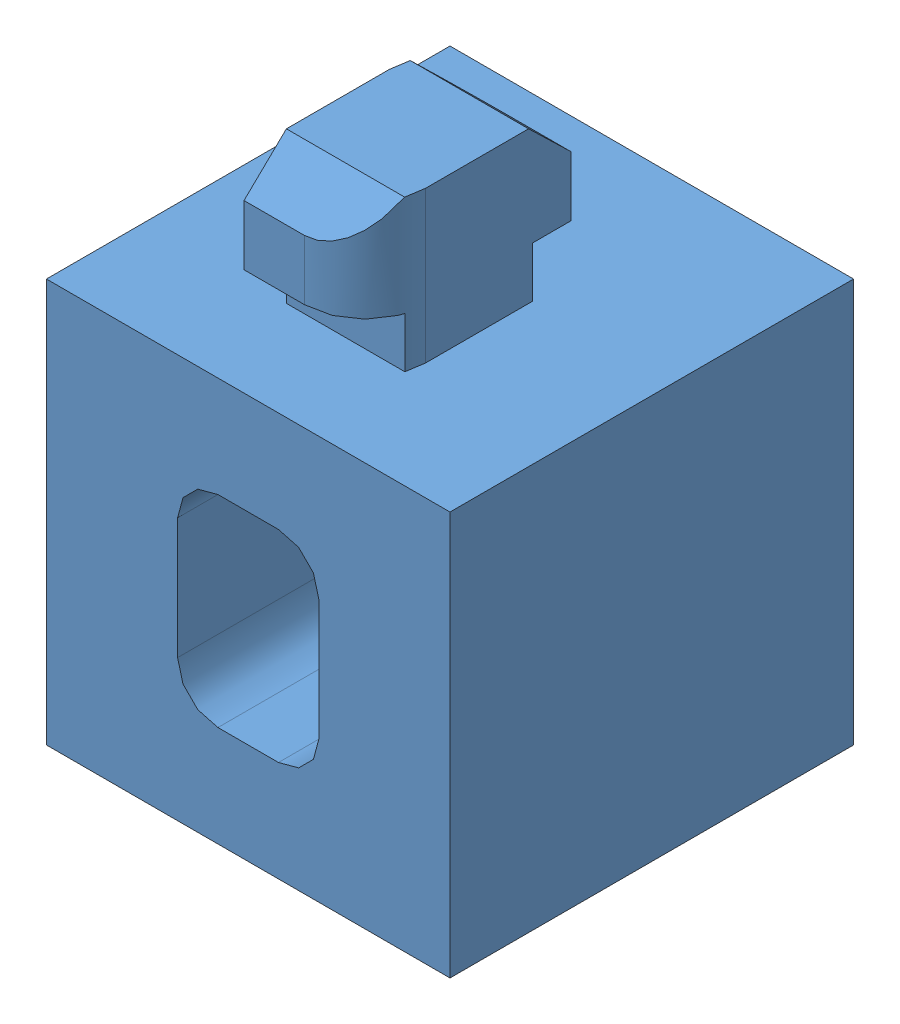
SolidWorks assembly J3AP5.SLDASM, configuration Default (file format 7000). Lengths in mm.
Overall size (20 27.5 20).
2 component instances, 2 part files, 3 mates.
Components (placement in the parent):
- J3APH-1: J3APH.SLDPRT [ﾃﾞﾌｫﾙﾄ] at origin size (20 27.5 20)
- J3N5-1: J3N5.SLDPRT [Default] at origin size (10 10 5)
Mates (geometry in assembly coordinates):
- 幅1: width anti-aligned: plane of J3N5-1 through (-5 5 2.5) normal (-1 0 0); plane of J3N5-1 through (5 5 2.5) normal (1 0 0); plane of J3APH-1 through (-3.5 -3 10) normal (1 0 0); plane of J3APH-1 through (3.5 -3 10) normal (-1 0 0)
- 幅2: width anti-aligned: plane of J3N5-1 through (-5 -5 2.5) normal (0 -1 0); plane of J3N5-1 through (-5 5 2.5) normal (0 1 0); plane of J3APH-1 through (-1.5 -5 10) normal (0 1 0); plane of J3APH-1 through (-1.5 5 10) normal (0 -1 0)
- 幅3: width anti-aligned: plane of J3N5-1 through (-5 5 2.5) normal (0 0 1); plane of J3N5-1 through (-5 5 -2.5) normal (0 0 -1); plane of J3APH-1 through (-5.4167 -8 2.7) normal (0 0 -1); plane of J3APH-1 through (-5.4167 -8 -2.7) normal (0 0 1)
